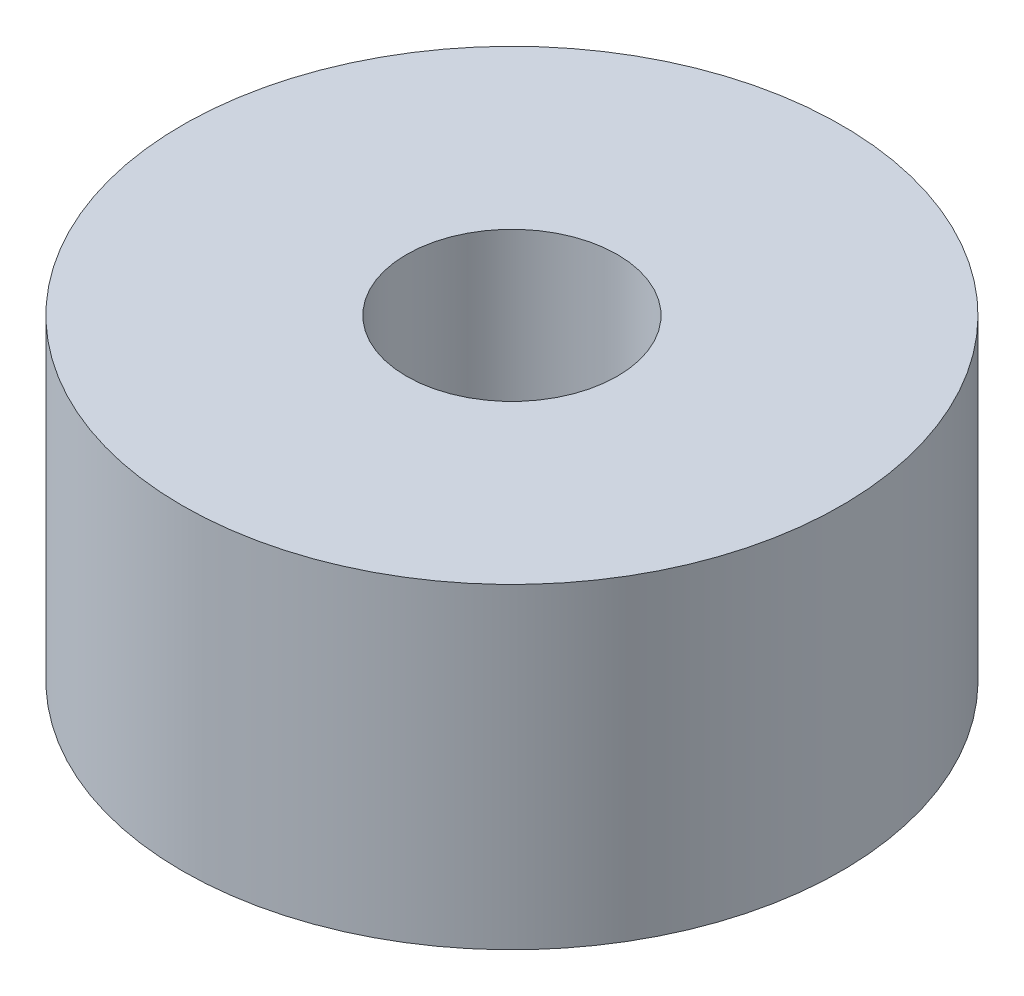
from build123d import *

# Parameters (mm, degrees)
SZKIC1_R                    = 12.5
SZKIC1_R_2                  = 4
DODANIE_WYCI_GNI_CIE1_DEPTH = 12


with BuildPart() as part:
    # Szkic1 → Dodanie-wyci_gni_cie1 (new body)
    with BuildSketch(Plane(origin=(0, 0, 0), x_dir=(1, 0, 0), z_dir=(0, 1, 0))):
        with Locations(Location((0, 0, 0), (0, 0, 270))):
            Circle(SZKIC1_R)
        with Locations(Location((0, 0, 0), (0, 0, 270))):
            Circle(SZKIC1_R_2, mode=Mode.SUBTRACT)
    extrude(amount=DODANIE_WYCI_GNI_CIE1_DEPTH)


solid = part.part
